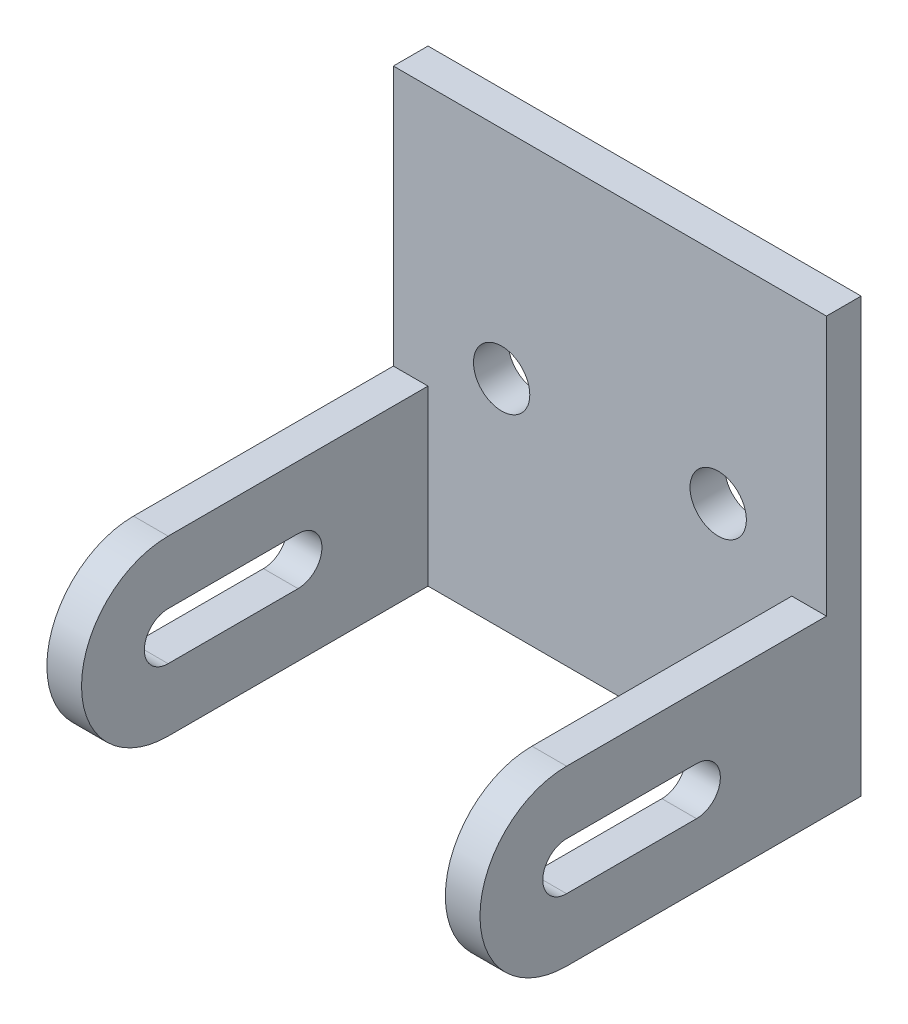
from build123d import *

# Parameters (mm, degrees)
SKIZZE1_W                       = 50
SKIZZE1_H                       = 50
SKIZZE1_R                       = 3.25
AUFSATZ_LINEAR_AUSTRAGEN1_DEPTH = 4
AUFSATZ_LINEAR_AUSTRAGEN2_DEPTH = 4
AUFSATZ_LINEAR_START            = -4
AUFSATZ_LINEAR_AUSTRAGEN3_DEPTH = 4


with BuildPart() as part:
    # Skizze1 → Aufsatz-Linear austragen1 (new body)
    with BuildSketch(Plane.XY):
        with Locations((25, -25)):
            Rectangle(SKIZZE1_W, SKIZZE1_H)
        with Locations((12.5, -25)):
            Circle(SKIZZE1_R, mode=Mode.SUBTRACT)
        with Locations(Location((37.5, -25, 0), (0, 0, 180))):
            Circle(SKIZZE1_R, mode=Mode.SUBTRACT)
    extrude(amount=AUFSATZ_LINEAR_AUSTRAGEN1_DEPTH)

    # Skizze2 → Aufsatz-Linear austragen2 (add)
    with BuildSketch(Plane.ZY):
        with BuildLine():
            Line((4, -50), (34, -50))
            ThreePointArc((34, -50), (44, -40), (34, -30))
            Line((34, -30), (4, -30))
            Line((4, -30), (4, -50))
        make_face()
        with BuildLine():
            Line((34, -42.75), (19, -42.75))
            ThreePointArc((19, -42.75), (16.25, -40), (19, -37.25))
            Line((19, -37.25), (34, -37.25))
            ThreePointArc((34, -37.25), (36.75, -40), (34, -42.75))
        make_face(mode=Mode.SUBTRACT)
    extrude(amount=-AUFSATZ_LINEAR_AUSTRAGEN2_DEPTH)

    # Skizze3 → Aufsatz-Linear austragen3 (add)
    with BuildSketch(Plane(origin=(50, 0, 0), x_dir=(0, 0, -1), z_dir=(1, 0, 0)).offset(AUFSATZ_LINEAR_START)):
        with BuildLine():
            Line((-34, -30), (-4, -30))
            Line((-4, -30), (-4, -50))
            Line((-4, -50), (-34, -50))
            ThreePointArc((-34, -50), (-44, -40), (-34, -30))
        make_face()
        with BuildLine():
            Line((-34, -37.25), (-19, -37.25))
            ThreePointArc((-19, -37.25), (-16.25, -40), (-19, -42.75))
            Line((-19, -42.75), (-34, -42.75))
            ThreePointArc((-34, -42.75), (-36.75, -40), (-34, -37.25))
        make_face(mode=Mode.SUBTRACT)
    extrude(amount=AUFSATZ_LINEAR_AUSTRAGEN3_DEPTH)


solid = part.part
